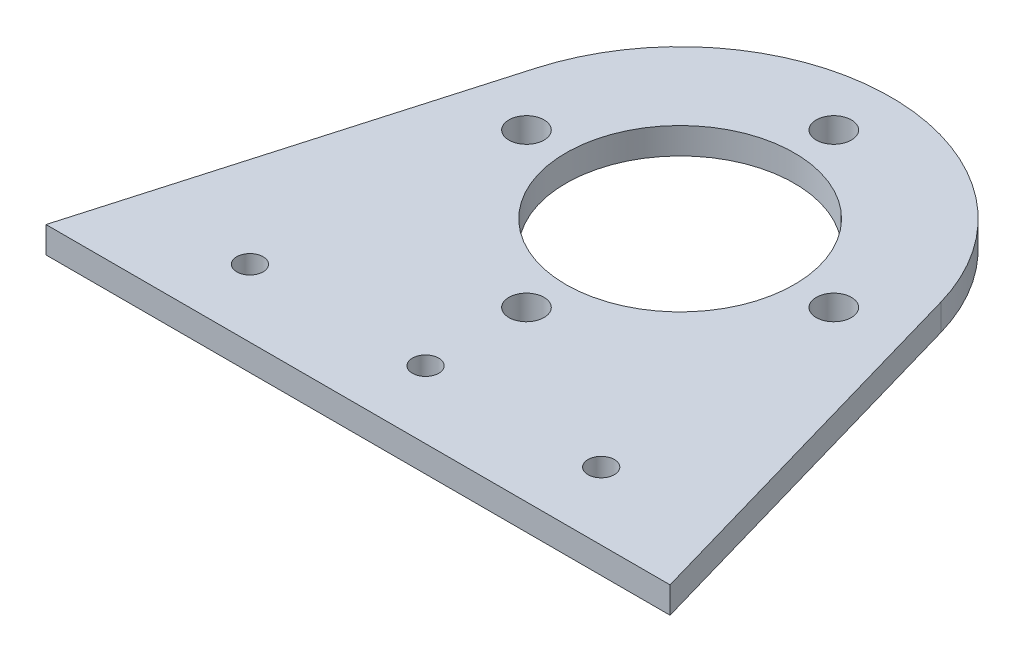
from build123d import *

# Parameters (mm, degrees)
SKETCH_1_R      = 13
SKETCH_1_R_2    = 1.5
SKETCH_1_R_3    = 2
EXTRUDE_1_DEPTH = 3


with BuildPart() as part:
    # Sketch 1 → Extrude 1 (new body)
    with BuildSketch(Plane(origin=(0, 0, 0), x_dir=(1, 0, 0), z_dir=(0, 1, 0))):
        with BuildLine():
            Line((-3.834134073, 8.431131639), (-16.302286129, -34.887977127))
            Line((-16.302286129, -34.887977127), (54.761409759, -34.887977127))
            Line((54.761409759, -34.887977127), (42.293257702, 8.431131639))
            ThreePointArc((42.293257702, 8.431131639), (19.229561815, 25.792914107), (-3.834134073, 8.431131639))
        make_face()
        with Locations(Location((19.229561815, 1.792914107, 0), (0, 0, 270))):
            Circle(SKETCH_1_R, mode=Mode.SUBTRACT)
        with Locations(Location((19.229561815, -27.196983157, 0), (0, 0, 270))):
            Circle(SKETCH_1_R_2, mode=Mode.SUBTRACT)
        with Locations(Location((-0.770438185, -27.196983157, 0), (0, 0, 270))):
            Circle(SKETCH_1_R_2, mode=Mode.SUBTRACT)
        with Locations(Location((39.229561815, -27.196983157, 0), (0, 0, 270))):
            Circle(SKETCH_1_R_2, mode=Mode.SUBTRACT)
        with Locations(Location((19.229561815, 19.292914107, 0), (0, 0, 270))):
            Circle(SKETCH_1_R_3, mode=Mode.SUBTRACT)
        with Locations(Location((36.729561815, 1.792914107, 0), (0, 0, 270))):
            Circle(SKETCH_1_R_3, mode=Mode.SUBTRACT)
        with Locations(Location((19.229561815, -15.707085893, 0), (0, 0, 270))):
            Circle(SKETCH_1_R_3, mode=Mode.SUBTRACT)
        with Locations(Location((1.729561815, 1.792914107, 0), (0, 0, 270))):
            Circle(SKETCH_1_R_3, mode=Mode.SUBTRACT)
    extrude(amount=EXTRUDE_1_DEPTH)


solid = part.part
